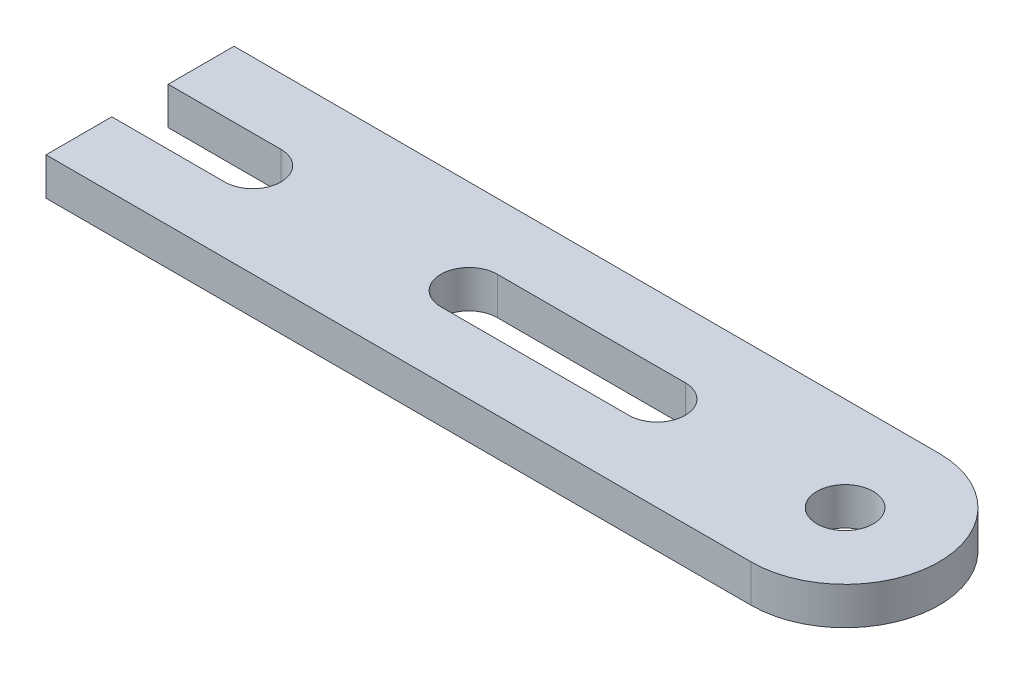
from build123d import *

# Parameters (mm, degrees)
SKETCH1_W          = 90
SKETCH1_H          = 20
EXTRUDE1_DEPTH     = 4
SKETCH2_R          = 3
CUT_EXTRUDE1_DEPTH = 93.28217596


with BuildPart() as part:
    # Sketch1 → Extrude1 (new body)
    with BuildSketch(Plane(origin=(0, 0, 0), x_dir=(1, 0, 0), z_dir=(0, 1, 0))):
        with Locations((45, 10)):
            Rectangle(SKETCH1_W, SKETCH1_H)
    extrude(amount=EXTRUDE1_DEPTH)

    # Sketch2 → Cut-Extrude1 (cut, through all)
    with BuildSketch(Plane(origin=(0, 4, 0), x_dir=(1, 0, 0), z_dir=(0, 1, 0))):
        with Locations(Location((75, 10, 0), (0, 0, 270))):
            Circle(SKETCH2_R)
        with BuildLine():
            Line((35, 13), (55, 13))
            ThreePointArc((55, 13), (58, 10), (55, 7))
            Line((55, 7), (35, 7))
            ThreePointArc((35, 7), (32, 10), (35, 13))
        make_face()
        with BuildLine():
            Line((12, 13), (0, 13))
            Line((0, 13), (0, 7))
            Line((0, 7), (12, 7))
            ThreePointArc((12, 7), (15, 10), (12, 13))
        make_face()
        with BuildLine():
            Line((75, 20), (90, 20))
            Line((90, 20), (90, 0))
            Line((90, 0), (75, 0))
            ThreePointArc((75, 0), (85, 10), (75, 20))
        make_face()
    extrude(amount=-CUT_EXTRUDE1_DEPTH, mode=Mode.SUBTRACT)


solid = part.part
